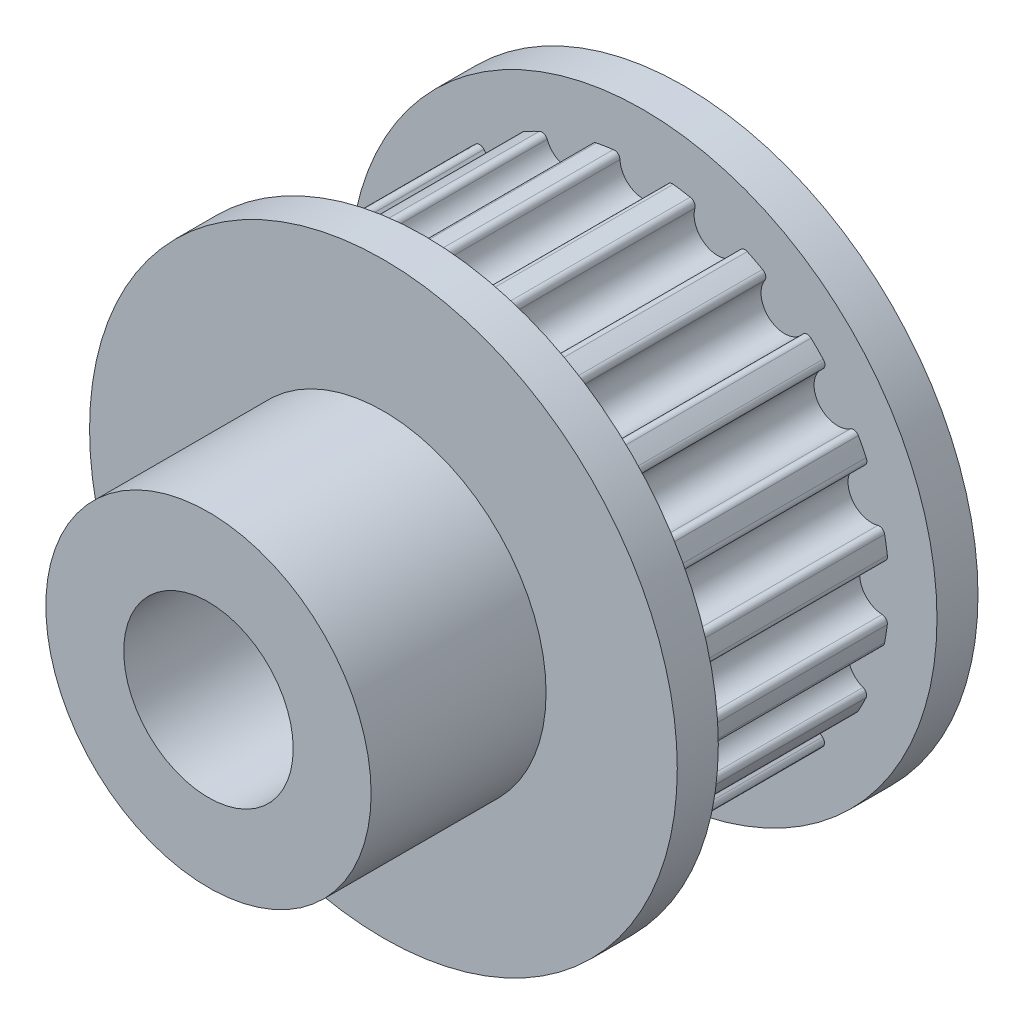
from build123d import *

# Parameters (mm, degrees)
SKETCH1_R           = 5.95
SKETCH1_R_2         = 3.1
BOSS_EXTRUDE1_DEPTH = 17.4
SKETCH2_R           = 10.75
SKETCH2_R_2         = 5.95
BOSS_EXTRUDE2_DEPTH = 1.5
SKETCH4_R           = 5.95
BOSS_EXTRUDE3_DEPTH = 8
SKETCH6_R           = 10.75
SKETCH6_R_2         = 5.95
BOSS_EXTRUDE4_DEPTH = 1.5


with BuildPart() as part:
    # Sketch1 → Boss-Extrude1 (new body)
    with BuildSketch(Plane.XY):
        Circle(SKETCH1_R)
        Circle(SKETCH1_R_2, mode=Mode.SUBTRACT)
    extrude(amount=BOSS_EXTRUDE1_DEPTH)

    # Sketch2 → Boss-Extrude2 (add)
    with BuildSketch(Plane.XY):
        Circle(SKETCH2_R)
        Circle(SKETCH2_R_2, mode=Mode.SUBTRACT)
    extrude(amount=BOSS_EXTRUDE2_DEPTH)

    # Sketch4 → Boss-Extrude3 (add)
    with BuildSketch(Plane.XY.offset(1.5)):
        with BuildLine():
            ThreePointArc((1.102516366, 8.9322146), (1.412869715, 8.888408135), (1.721509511, 8.833821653))
            ThreePointArc((1.721509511, 8.833821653), (1.868197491, 8.745399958), (1.896208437, 8.576429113))
            ThreePointArc((1.896208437, 8.576429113), (2.461553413, 7.529651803), (3.534207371, 8.044210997))
            ThreePointArc((3.534207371, 8.044210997), (3.64731341, 8.159534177), (3.808761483, 8.154344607))
            ThreePointArc((3.808761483, 8.154344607), (4.090388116, 8.016777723), (4.367053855, 7.869487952))
            ThreePointArc((4.367053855, 7.869487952), (4.479238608, 7.740064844), (4.453663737, 7.570708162))
            ThreePointArc((4.453663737, 7.570708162), (4.667866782, 6.400462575), (5.847028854, 6.558369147))
            ThreePointArc((5.847028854, 6.558369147), (5.990235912, 6.633096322), (6.142178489, 6.578270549))
            ThreePointArc((6.142178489, 6.578270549), (6.367510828, 6.360409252), (6.58512054, 6.13483394))
            ThreePointArc((6.58512054, 6.13483394), (6.65182064, 5.977078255), (6.5751634, 5.823913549))
            ThreePointArc((6.5751634, 5.823913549), (6.417256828, 4.644751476), (7.587502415, 4.430548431))
            ThreePointArc((7.587502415, 4.430548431), (7.746792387, 4.457364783), (7.874356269, 4.358269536))
            ThreePointArc((7.874356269, 4.358269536), (8.021337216, 4.081439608), (8.158589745, 3.799659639))
            ThreePointArc((8.158589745, 3.799659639), (8.173276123, 3.629013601), (8.053040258, 3.507033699))
            ThreePointArc((8.053040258, 3.507033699), (7.538481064, 2.434379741), (8.585258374, 1.869034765))
            ThreePointArc((8.585258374, 1.869034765), (8.745038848, 1.845315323), (8.835737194, 1.711650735))
            ThreePointArc((8.835737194, 1.711650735), (8.889979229, 1.402950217), (8.933439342, 1.092548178))
            ThreePointArc((8.933439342, 1.092548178), (8.894674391, 0.925715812), (8.742629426, 0.846860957))
            ThreePointArc((8.742629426, 0.846860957), (7.92178625, -0.014286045), (8.742629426, -0.875433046))
            ThreePointArc((8.742629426, -0.875433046), (8.887259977, -0.947366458), (8.9322146, -1.102516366))
            ThreePointArc((8.9322146, -1.102516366), (8.888408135, -1.412869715), (8.833821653, -1.721509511))
            ThreePointArc((8.833821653, -1.721509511), (8.745399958, -1.868197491), (8.576429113, -1.896208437))
            ThreePointArc((8.576429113, -1.896208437), (7.529651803, -2.461553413), (8.044210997, -3.534207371))
            ThreePointArc((8.044210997, -3.534207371), (8.159534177, -3.64731341), (8.154344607, -3.808761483))
            ThreePointArc((8.154344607, -3.808761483), (8.016777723, -4.090388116), (7.869487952, -4.367053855))
            ThreePointArc((7.869487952, -4.367053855), (7.740064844, -4.479238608), (7.570708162, -4.453663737))
            ThreePointArc((7.570708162, -4.453663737), (6.400462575, -4.667866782), (6.558369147, -5.847028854))
            ThreePointArc((6.558369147, -5.847028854), (6.633096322, -5.990235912), (6.578270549, -6.142178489))
            ThreePointArc((6.578270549, -6.142178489), (6.360409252, -6.367510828), (6.13483394, -6.58512054))
            ThreePointArc((6.13483394, -6.58512054), (5.977078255, -6.65182064), (5.823913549, -6.5751634))
            ThreePointArc((5.823913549, -6.5751634), (4.644751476, -6.417256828), (4.430548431, -7.587502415))
            ThreePointArc((4.430548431, -7.587502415), (4.457364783, -7.746792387), (4.358269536, -7.874356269))
            ThreePointArc((4.358269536, -7.874356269), (4.081439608, -8.021337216), (3.799659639, -8.158589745))
            ThreePointArc((3.799659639, -8.158589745), (3.629013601, -8.173276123), (3.507033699, -8.053040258))
            ThreePointArc((3.507033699, -8.053040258), (2.434379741, -7.538481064), (1.869034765, -8.585258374))
            ThreePointArc((1.869034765, -8.585258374), (1.845315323, -8.745038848), (1.711650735, -8.835737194))
            ThreePointArc((1.711650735, -8.835737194), (1.402950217, -8.889979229), (1.092548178, -8.933439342))
            ThreePointArc((1.092548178, -8.933439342), (0.925715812, -8.894674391), (0.846860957, -8.742629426))
            ThreePointArc((0.846860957, -8.742629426), (-0.014286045, -7.92178625), (-0.875433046, -8.742629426))
            ThreePointArc((-0.875433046, -8.742629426), (-0.947366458, -8.887259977), (-1.102516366, -8.9322146))
            ThreePointArc((-1.102516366, -8.9322146), (-1.412869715, -8.888408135), (-1.721509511, -8.833821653))
            ThreePointArc((-1.721509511, -8.833821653), (-1.868197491, -8.745399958), (-1.896208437, -8.576429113))
            ThreePointArc((-1.896208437, -8.576429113), (-2.461553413, -7.529651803), (-3.534207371, -8.044210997))
            ThreePointArc((-3.534207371, -8.044210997), (-3.64731341, -8.159534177), (-3.808761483, -8.154344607))
            ThreePointArc((-3.808761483, -8.154344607), (-4.090388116, -8.016777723), (-4.367053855, -7.869487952))
            ThreePointArc((-4.367053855, -7.869487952), (-4.479238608, -7.740064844), (-4.453663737, -7.570708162))
            ThreePointArc((-4.453663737, -7.570708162), (-4.667866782, -6.400462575), (-5.847028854, -6.558369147))
            ThreePointArc((-5.847028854, -6.558369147), (-5.990235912, -6.633096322), (-6.142178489, -6.578270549))
            ThreePointArc((-6.142178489, -6.578270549), (-6.367510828, -6.360409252), (-6.58512054, -6.13483394))
            ThreePointArc((-6.58512054, -6.13483394), (-6.65182064, -5.977078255), (-6.5751634, -5.823913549))
            ThreePointArc((-6.5751634, -5.823913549), (-6.417256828, -4.644751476), (-7.587502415, -4.430548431))
            ThreePointArc((-7.587502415, -4.430548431), (-7.746792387, -4.457364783), (-7.874356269, -4.358269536))
            ThreePointArc((-7.874356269, -4.358269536), (-8.021337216, -4.081439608), (-8.158589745, -3.799659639))
            ThreePointArc((-8.158589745, -3.799659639), (-8.173276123, -3.629013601), (-8.053040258, -3.507033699))
            ThreePointArc((-8.053040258, -3.507033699), (-7.538481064, -2.434379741), (-8.585258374, -1.869034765))
            ThreePointArc((-8.585258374, -1.869034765), (-8.745038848, -1.845315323), (-8.835737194, -1.711650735))
            ThreePointArc((-8.835737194, -1.711650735), (-8.889979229, -1.402950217), (-8.933439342, -1.092548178))
            ThreePointArc((-8.933439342, -1.092548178), (-8.894674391, -0.925715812), (-8.742629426, -0.846860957))
            ThreePointArc((-8.742629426, -0.846860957), (-7.92178625, 0.014286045), (-8.742629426, 0.875433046))
            ThreePointArc((-8.742629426, 0.875433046), (-8.887259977, 0.947366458), (-8.9322146, 1.102516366))
            ThreePointArc((-8.9322146, 1.102516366), (-8.888408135, 1.412869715), (-8.833821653, 1.721509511))
            ThreePointArc((-8.833821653, 1.721509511), (-8.745399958, 1.868197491), (-8.576429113, 1.896208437))
            ThreePointArc((-8.576429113, 1.896208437), (-7.529651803, 2.461553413), (-8.044210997, 3.534207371))
            ThreePointArc((-8.044210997, 3.534207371), (-8.159534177, 3.64731341), (-8.154344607, 3.808761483))
            ThreePointArc((-8.154344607, 3.808761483), (-8.016777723, 4.090388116), (-7.869487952, 4.367053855))
            ThreePointArc((-7.869487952, 4.367053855), (-7.740064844, 4.479238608), (-7.570708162, 4.453663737))
            ThreePointArc((-7.570708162, 4.453663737), (-6.400462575, 4.667866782), (-6.558369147, 5.847028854))
            ThreePointArc((-6.558369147, 5.847028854), (-6.633096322, 5.990235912), (-6.578270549, 6.142178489))
            ThreePointArc((-6.578270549, 6.142178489), (-6.360409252, 6.367510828), (-6.13483394, 6.58512054))
            ThreePointArc((-6.13483394, 6.58512054), (-5.977078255, 6.65182064), (-5.823913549, 6.5751634))
            ThreePointArc((-5.823913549, 6.5751634), (-4.644751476, 6.417256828), (-4.430548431, 7.587502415))
            ThreePointArc((-4.430548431, 7.587502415), (-4.457364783, 7.746792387), (-4.358269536, 7.874356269))
            ThreePointArc((-4.358269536, 7.874356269), (-4.081439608, 8.021337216), (-3.799659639, 8.158589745))
            ThreePointArc((-3.799659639, 8.158589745), (-3.629013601, 8.173276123), (-3.507033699, 8.053040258))
            ThreePointArc((-3.507033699, 8.053040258), (-2.434379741, 7.538481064), (-1.869034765, 8.585258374))
            ThreePointArc((-1.869034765, 8.585258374), (-1.845315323, 8.745038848), (-1.711650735, 8.835737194))
            ThreePointArc((-1.711650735, 8.835737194), (-1.402950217, 8.889979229), (-1.092548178, 8.933439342))
            ThreePointArc((-1.092548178, 8.933439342), (-0.925715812, 8.894674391), (-0.846860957, 8.742629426))
            ThreePointArc((-0.846860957, 8.742629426), (0.014286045, 7.92178625), (0.875433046, 8.742629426))
            ThreePointArc((0.875433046, 8.742629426), (0.947366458, 8.887259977), (1.102516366, 8.9322146))
        make_face()
        Circle(SKETCH4_R, mode=Mode.SUBTRACT)
    extrude(amount=BOSS_EXTRUDE3_DEPTH)

    # Sketch6 → Boss-Extrude4 (add)
    with BuildSketch(Plane.XY.offset(9.5)):
        Circle(SKETCH6_R)
        Circle(SKETCH6_R_2, mode=Mode.SUBTRACT)
    extrude(amount=BOSS_EXTRUDE4_DEPTH)


solid = part.part
